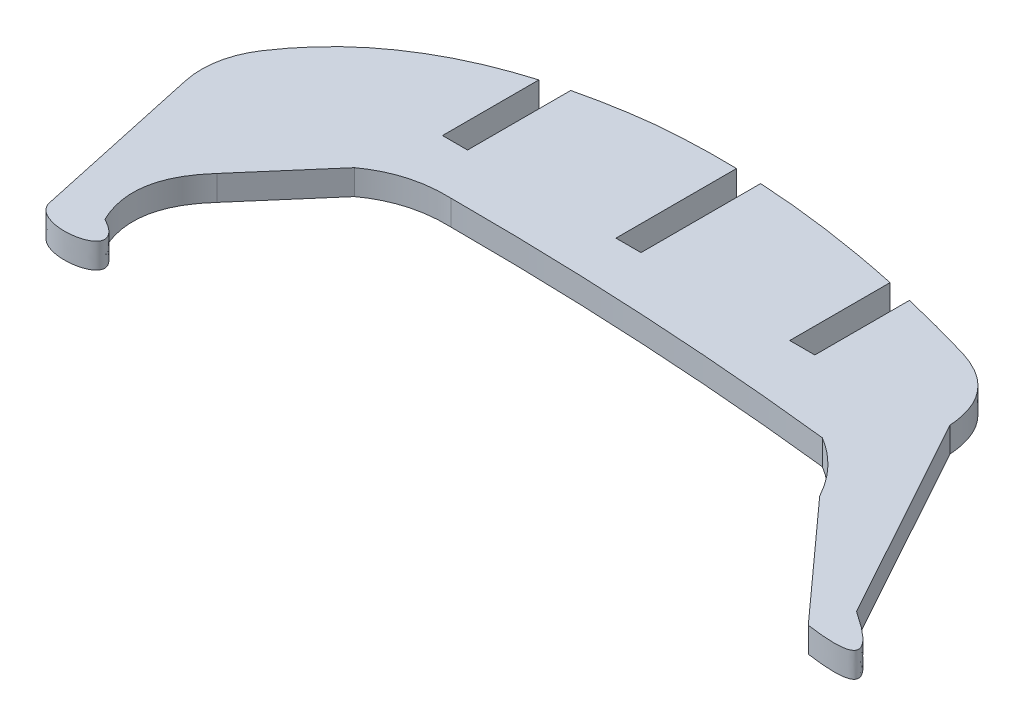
ISO-10303-21;
HEADER;
FILE_DESCRIPTION(('STEP AP214'),'2;1');
FILE_NAME('part.step','',(''),(''),'','','');
FILE_SCHEMA(('AUTOMOTIVE_DESIGN { 1 0 10303 214 1 1 1 1 }'));
ENDSEC;
DATA;
#1=APPLICATION_CONTEXT('core data for automotive mechanical design processes');
#2=APPLICATION_PROTOCOL_DEFINITION('international standard','automotive_design',2000,#1);
#3=PRODUCT_CONTEXT('',#1,'mechanical');
#4=PRODUCT('Part','Part','',(#3));
#5=PRODUCT_RELATED_PRODUCT_CATEGORY('part','',(#4));
#6=PRODUCT_DEFINITION_FORMATION('','',#4);
#7=PRODUCT_DEFINITION_CONTEXT('part definition',#1,'design');
#8=PRODUCT_DEFINITION('design','',#6,#7);
#9=PRODUCT_DEFINITION_SHAPE('','',#8);
#10=(LENGTH_UNIT() NAMED_UNIT(*) SI_UNIT(.MILLI.,.METRE.));
#11=(NAMED_UNIT(*) PLANE_ANGLE_UNIT() SI_UNIT($,.RADIAN.));
#12=(NAMED_UNIT(*) SI_UNIT($,.STERADIAN.) SOLID_ANGLE_UNIT());
#13=UNCERTAINTY_MEASURE_WITH_UNIT(LENGTH_MEASURE(1.E-05),#10,'distance_accuracy_value','');
#14=(GEOMETRIC_REPRESENTATION_CONTEXT(3) GLOBAL_UNCERTAINTY_ASSIGNED_CONTEXT((#13)) GLOBAL_UNIT_ASSIGNED_CONTEXT((#10,
#11,#12)) REPRESENTATION_CONTEXT('',''));
#15=CARTESIAN_POINT('',(0.,0.,0.));
#16=DIRECTION('',(0.,0.,1.));
#17=DIRECTION('',(1.,0.,0.));
#18=AXIS2_PLACEMENT_3D('',#15,#16,#17);
#19=CARTESIAN_POINT('',(18.7065995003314,3.,-27.285407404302));
#20=DIRECTION('',(1.,0.,0.));
#21=DIRECTION('',(0.,0.,-1.));
#22=AXIS2_PLACEMENT_3D('',#19,#20,#21);
#23=PLANE('',#22);
#24=DIRECTION('',(0.,0.,1.));
#25=VECTOR('',#24,1.);
#26=CARTESIAN_POINT('',(18.7065995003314,0.,-27.285407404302));
#27=LINE('',#26,#25);
#28=CARTESIAN_POINT('',(18.7065995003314,0.,-27.285407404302));
#29=VERTEX_POINT('',#28);
#30=CARTESIAN_POINT('',(18.7065995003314,0.,-12.978867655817));
#31=VERTEX_POINT('',#30);
#32=EDGE_CURVE('E245',#29,#31,#27,.T.);
#33=ORIENTED_EDGE('',*,*,#32,.T.);
#34=DIRECTION('',(0.,-1.,0.));
#35=VECTOR('',#34,1.);
#36=CARTESIAN_POINT('',(18.7065995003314,3.,-12.978867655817));
#37=LINE('',#36,#35);
#38=CARTESIAN_POINT('',(18.7065995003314,3.,-12.978867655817));
#39=VERTEX_POINT('',#38);
#40=EDGE_CURVE('E11',#39,#31,#37,.T.);
#41=ORIENTED_EDGE('',*,*,#40,.F.);
#42=DIRECTION('',(0.,0.,1.));
#43=VECTOR('',#42,1.);
#44=CARTESIAN_POINT('',(18.7065995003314,3.,-27.285407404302));
#45=LINE('',#44,#43);
#46=CARTESIAN_POINT('',(18.7065995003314,3.,-27.285407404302));
#47=VERTEX_POINT('',#46);
#48=EDGE_CURVE('E146',#47,#39,#45,.T.);
#49=ORIENTED_EDGE('',*,*,#48,.F.);
#50=DIRECTION('',(0.,-1.,0.));
#51=VECTOR('',#50,1.);
#52=CARTESIAN_POINT('',(18.7065995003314,3.,-27.285407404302));
#53=LINE('',#52,#51);
#54=EDGE_CURVE('E55',#47,#29,#53,.T.);
#55=ORIENTED_EDGE('',*,*,#54,.T.);
#56=EDGE_LOOP('',(#33,#41,#49,#55));
#57=FACE_BOUND('',#56,.T.);
#58=ADVANCED_FACE('F39',(#57),#23,.F.);
#59=CARTESIAN_POINT('',(15.7065994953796,3.,-12.978867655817));
#60=DIRECTION('',(0.,0.,-1.));
#61=DIRECTION('',(-1.,0.,0.));
#62=AXIS2_PLACEMENT_3D('',#59,#60,#61);
#63=PLANE('',#62);
#64=DIRECTION('',(1.,0.,0.));
#65=VECTOR('',#64,1.);
#66=CARTESIAN_POINT('',(15.7065994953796,0.,-12.978867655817));
#67=LINE('',#66,#65);
#68=CARTESIAN_POINT('',(15.7065994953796,0.,-12.978867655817));
#69=VERTEX_POINT('',#68);
#70=EDGE_CURVE('E486',#69,#31,#67,.T.);
#71=ORIENTED_EDGE('',*,*,#70,.F.);
#72=DIRECTION('',(0.,-1.,0.));
#73=VECTOR('',#72,1.);
#74=CARTESIAN_POINT('',(15.7065994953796,3.,-12.978867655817));
#75=LINE('',#74,#73);
#76=CARTESIAN_POINT('',(15.7065994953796,3.,-12.978867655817));
#77=VERTEX_POINT('',#76);
#78=EDGE_CURVE('E47',#77,#69,#75,.T.);
#79=ORIENTED_EDGE('',*,*,#78,.F.);
#80=DIRECTION('',(1.,0.,0.));
#81=VECTOR('',#80,1.);
#82=CARTESIAN_POINT('',(15.7065994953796,3.,-12.978867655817));
#83=LINE('',#82,#81);
#84=EDGE_CURVE('E658',#77,#39,#83,.T.);
#85=ORIENTED_EDGE('',*,*,#84,.T.);
#86=ORIENTED_EDGE('',*,*,#40,.T.);
#87=EDGE_LOOP('',(#71,#79,#85,#86));
#88=FACE_BOUND('',#87,.T.);
#89=ADVANCED_FACE('F487',(#88),#63,.T.);
#90=CARTESIAN_POINT('',(15.7065994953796,3.,-27.4047164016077));
#91=DIRECTION('',(1.,0.,0.));
#92=DIRECTION('',(0.,0.,-1.));
#93=AXIS2_PLACEMENT_3D('',#90,#91,#92);
#94=PLANE('',#93);
#95=DIRECTION('',(0.,0.,1.));
#96=VECTOR('',#95,1.);
#97=CARTESIAN_POINT('',(15.7065994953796,0.,-27.4047164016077));
#98=LINE('',#97,#96);
#99=CARTESIAN_POINT('',(15.7065994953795,0.,-27.4047164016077));
#100=VERTEX_POINT('',#99);
#101=EDGE_CURVE('E479',#100,#69,#98,.T.);
#102=ORIENTED_EDGE('',*,*,#101,.F.);
#103=DIRECTION('',(0.,-1.,0.));
#104=VECTOR('',#103,1.);
#105=CARTESIAN_POINT('',(15.7065994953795,3.,-27.4047164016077));
#106=LINE('',#105,#104);
#107=CARTESIAN_POINT('',(15.7065994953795,3.,-27.4047164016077));
#108=VERTEX_POINT('',#107);
#109=EDGE_CURVE('E472',#108,#100,#106,.T.);
#110=ORIENTED_EDGE('',*,*,#109,.F.);
#111=DIRECTION('',(0.,0.,1.));
#112=VECTOR('',#111,1.);
#113=CARTESIAN_POINT('',(15.7065994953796,3.,-27.4047164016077));
#114=LINE('',#113,#112);
#115=EDGE_CURVE('E482',#108,#77,#114,.T.);
#116=ORIENTED_EDGE('',*,*,#115,.T.);
#117=ORIENTED_EDGE('',*,*,#78,.T.);
#118=EDGE_LOOP('',(#102,#110,#116,#117));
#119=FACE_BOUND('',#118,.T.);
#120=ADVANCED_FACE('F477',(#119),#94,.T.);
#121=CARTESIAN_POINT('',(6.23728601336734,3.,-27.0796653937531));
#122=CARTESIAN_POINT('',(9.2708349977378,3.,-27.3725993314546));
#123=CARTESIAN_POINT('',(12.4272728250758,3.,-27.4809496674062));
#124=CARTESIAN_POINT('',(15.7065994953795,3.,-27.4047164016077));
#125=B_SPLINE_CURVE_WITH_KNOTS('',3,(#121,#122,#123,#124),.UNSPECIFIED.,.F.,.F.,(4,4),
(0.396665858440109,0.548130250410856),.UNSPECIFIED.);
#126=DIRECTION('',(0.,-1.,0.));
#127=VECTOR('',#126,1.);
#128=SURFACE_OF_LINEAR_EXTRUSION('',#125,#127);
#129=CARTESIAN_POINT('',(6.23728601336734,0.,-27.0796653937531));
#130=CARTESIAN_POINT('',(9.2708349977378,0.,-27.3725993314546));
#131=CARTESIAN_POINT('',(12.4272728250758,0.,-27.4809496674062));
#132=CARTESIAN_POINT('',(15.7065994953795,0.,-27.4047164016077));
#133=B_SPLINE_CURVE_WITH_KNOTS('',3,(#129,#130,#131,#132),.UNSPECIFIED.,.F.,.F.,(4,4),
(0.396665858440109,0.548130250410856),.UNSPECIFIED.);
#134=CARTESIAN_POINT('',(6.23728601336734,0.,-27.0796653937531));
#135=VERTEX_POINT('',#134);
#136=EDGE_CURVE('E491',#135,#100,#133,.T.);
#137=ORIENTED_EDGE('',*,*,#136,.F.);
#138=DIRECTION('',(0.,-1.,0.));
#139=VECTOR('',#138,1.);
#140=CARTESIAN_POINT('',(6.23728601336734,3.,-27.0796653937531));
#141=LINE('',#140,#139);
#142=CARTESIAN_POINT('',(6.23728601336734,3.,-27.0796653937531));
#143=VERTEX_POINT('',#142);
#144=EDGE_CURVE('E470',#143,#135,#141,.T.);
#145=ORIENTED_EDGE('',*,*,#144,.F.);
#146=EDGE_CURVE('E432',#143,#108,#125,.T.);
#147=ORIENTED_EDGE('',*,*,#146,.T.);
#148=ORIENTED_EDGE('',*,*,#109,.T.);
#149=EDGE_LOOP('',(#137,#145,#147,#148));
#150=FACE_BOUND('',#149,.T.);
#151=ADVANCED_FACE('F421',(#150),#128,.T.);
#152=CARTESIAN_POINT('',(-2.29340050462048,3.,-25.5718308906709));
#153=CARTESIAN_POINT('',(1.93618210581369,3.,-26.5898860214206));
#154=CARTESIAN_POINT('',(6.23728601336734,3.,-27.0796653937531));
#155=B_SPLINE_CURVE_WITH_KNOTS('',2,(#152,#153,#154),.UNSPECIFIED.,.F.,.F.,(3,3),
(0.783562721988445,1.),.UNSPECIFIED.);
#156=DIRECTION('',(0.,-1.,0.));
#157=VECTOR('',#156,1.);
#158=SURFACE_OF_LINEAR_EXTRUSION('',#155,#157);
#159=CARTESIAN_POINT('',(-2.29340050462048,0.,-25.5718308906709));
#160=CARTESIAN_POINT('',(1.93618210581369,0.,-26.5898860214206));
#161=CARTESIAN_POINT('',(6.23728601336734,0.,-27.0796653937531));
#162=B_SPLINE_CURVE_WITH_KNOTS('',2,(#159,#160,#161),.UNSPECIFIED.,.F.,.F.,(3,3),
(0.783562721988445,1.),.UNSPECIFIED.);
#163=CARTESIAN_POINT('',(-2.29340050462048,0.,-25.5718308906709));
#164=VERTEX_POINT('',#163);
#165=EDGE_CURVE('E493',#164,#135,#162,.T.);
#166=ORIENTED_EDGE('',*,*,#165,.F.);
#167=DIRECTION('',(0.,-1.,0.));
#168=VECTOR('',#167,1.);
#169=CARTESIAN_POINT('',(-2.29340050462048,3.,-25.5718308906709));
#170=LINE('',#169,#168);
#171=CARTESIAN_POINT('',(-2.29340050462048,3.,-25.5718308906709));
#172=VERTEX_POINT('',#171);
#173=EDGE_CURVE('E468',#172,#164,#170,.T.);
#174=ORIENTED_EDGE('',*,*,#173,.F.);
#175=EDGE_CURVE('E425',#172,#143,#155,.T.);
#176=ORIENTED_EDGE('',*,*,#175,.T.);
#177=ORIENTED_EDGE('',*,*,#144,.T.);
#178=EDGE_LOOP('',(#166,#174,#176,#177));
#179=FACE_BOUND('',#178,.T.);
#180=ADVANCED_FACE('F416',(#179),#158,.T.);
#181=CARTESIAN_POINT('',(-2.29340050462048,3.,-25.5718308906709));
#182=DIRECTION('',(1.,0.,0.));
#183=DIRECTION('',(0.,0.,-1.));
#184=AXIS2_PLACEMENT_3D('',#181,#182,#183);
#185=PLANE('',#184);
#186=DIRECTION('',(0.,0.,1.));
#187=VECTOR('',#186,1.);
#188=CARTESIAN_POINT('',(-2.29340050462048,0.,-25.5718308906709));
#189=LINE('',#188,#187);
#190=CARTESIAN_POINT('',(-2.29340050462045,0.,-13.2320208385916));
#191=VERTEX_POINT('',#190);
#192=EDGE_CURVE('E504',#164,#191,#189,.T.);
#193=ORIENTED_EDGE('',*,*,#192,.T.);
#194=DIRECTION('',(0.,-1.,0.));
#195=VECTOR('',#194,1.);
#196=CARTESIAN_POINT('',(-2.29340050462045,3.,-13.2320208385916));
#197=LINE('',#196,#195);
#198=CARTESIAN_POINT('',(-2.29340050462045,3.,-13.2320208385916));
#199=VERTEX_POINT('',#198);
#200=EDGE_CURVE('E466',#199,#191,#197,.T.);
#201=ORIENTED_EDGE('',*,*,#200,.F.);
#202=DIRECTION('',(0.,0.,1.));
#203=VECTOR('',#202,1.);
#204=CARTESIAN_POINT('',(-2.29340050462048,3.,-25.5718308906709));
#205=LINE('',#204,#203);
#206=EDGE_CURVE('E431',#172,#199,#205,.T.);
#207=ORIENTED_EDGE('',*,*,#206,.F.);
#208=ORIENTED_EDGE('',*,*,#173,.T.);
#209=EDGE_LOOP('',(#193,#201,#207,#208));
#210=FACE_BOUND('',#209,.T.);
#211=ADVANCED_FACE('F412',(#210),#185,.F.);
#212=CARTESIAN_POINT('',(-5.29340051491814,3.,-13.2320208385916));
#213=DIRECTION('',(0.,0.,-1.));
#214=DIRECTION('',(-1.,0.,0.));
#215=AXIS2_PLACEMENT_3D('',#212,#213,#214);
#216=PLANE('',#215);
#217=DIRECTION('',(1.,0.,0.));
#218=VECTOR('',#217,1.);
#219=CARTESIAN_POINT('',(-5.29340051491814,0.,-13.2320208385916));
#220=LINE('',#219,#218);
#221=CARTESIAN_POINT('',(-5.29340051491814,0.,-13.2320208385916));
#222=VERTEX_POINT('',#221);
#223=EDGE_CURVE('E510',#222,#191,#220,.T.);
#224=ORIENTED_EDGE('',*,*,#223,.F.);
#225=DIRECTION('',(0.,-1.,0.));
#226=VECTOR('',#225,1.);
#227=CARTESIAN_POINT('',(-5.29340051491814,3.,-13.2320208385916));
#228=LINE('',#227,#226);
#229=CARTESIAN_POINT('',(-5.29340051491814,3.,-13.2320208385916));
#230=VERTEX_POINT('',#229);
#231=EDGE_CURVE('E446',#230,#222,#228,.T.);
#232=ORIENTED_EDGE('',*,*,#231,.F.);
#233=DIRECTION('',(1.,0.,0.));
#234=VECTOR('',#233,1.);
#235=CARTESIAN_POINT('',(-5.29340051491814,3.,-13.2320208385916));
#236=LINE('',#235,#234);
#237=EDGE_CURVE('E440',#230,#199,#236,.T.);
#238=ORIENTED_EDGE('',*,*,#237,.T.);
#239=ORIENTED_EDGE('',*,*,#200,.T.);
#240=EDGE_LOOP('',(#224,#232,#238,#239));
#241=FACE_BOUND('',#240,.T.);
#242=ADVANCED_FACE('F408',(#241),#216,.T.);
#243=CARTESIAN_POINT('',(-5.29340051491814,3.,-24.765059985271));
#244=DIRECTION('',(1.,0.,0.));
#245=DIRECTION('',(0.,0.,-1.));
#246=AXIS2_PLACEMENT_3D('',#243,#244,#245);
#247=PLANE('',#246);
#248=DIRECTION('',(0.,0.,1.));
#249=VECTOR('',#248,1.);
#250=CARTESIAN_POINT('',(-5.29340051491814,0.,-24.765059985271));
#251=LINE('',#250,#249);
#252=CARTESIAN_POINT('',(-5.29340051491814,0.,-24.765059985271));
#253=VERTEX_POINT('',#252);
#254=EDGE_CURVE('E513',#253,#222,#251,.T.);
#255=ORIENTED_EDGE('',*,*,#254,.F.);
#256=DIRECTION('',(0.,-1.,0.));
#257=VECTOR('',#256,1.);
#258=CARTESIAN_POINT('',(-5.29340051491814,3.,-24.765059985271));
#259=LINE('',#258,#257);
#260=CARTESIAN_POINT('',(-5.29340051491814,3.,-24.765059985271));
#261=VERTEX_POINT('',#260);
#262=EDGE_CURVE('E448',#261,#253,#259,.T.);
#263=ORIENTED_EDGE('',*,*,#262,.F.);
#264=DIRECTION('',(0.,0.,1.));
#265=VECTOR('',#264,1.);
#266=CARTESIAN_POINT('',(-5.29340051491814,3.,-24.765059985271));
#267=LINE('',#266,#265);
#268=EDGE_CURVE('E393',#261,#230,#267,.T.);
#269=ORIENTED_EDGE('',*,*,#268,.T.);
#270=ORIENTED_EDGE('',*,*,#231,.T.);
#271=EDGE_LOOP('',(#255,#263,#269,#270));
#272=FACE_BOUND('',#271,.T.);
#273=ADVANCED_FACE('F404',(#272),#247,.T.);
#274=CARTESIAN_POINT('',(-24.9177923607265,3.,-11.1706000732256));
#275=CARTESIAN_POINT('',(-21.2160454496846,3.,-16.7884184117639));
#276=CARTESIAN_POINT('',(-14.6220548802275,3.,-21.5472950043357));
#277=CARTESIAN_POINT('',(-7.02427865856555,3.,-24.2475556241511));
#278=CARTESIAN_POINT('',(-5.29340051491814,3.,-24.765059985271));
#279=B_SPLINE_CURVE_WITH_KNOTS('',3,(#274,#275,#276,#277,#278),.UNSPECIFIED.,.F.,.F.,(4,1,4),
(0.102537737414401,0.571137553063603,0.706215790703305),.UNSPECIFIED.);
#280=DIRECTION('',(0.,-1.,0.));
#281=VECTOR('',#280,1.);
#282=SURFACE_OF_LINEAR_EXTRUSION('',#279,#281);
#283=CARTESIAN_POINT('',(-24.9177923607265,0.,-11.1706000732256));
#284=CARTESIAN_POINT('',(-21.2160454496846,0.,-16.7884184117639));
#285=CARTESIAN_POINT('',(-14.6220548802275,0.,-21.5472950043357));
#286=CARTESIAN_POINT('',(-7.02427865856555,0.,-24.2475556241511));
#287=CARTESIAN_POINT('',(-5.29340051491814,0.,-24.765059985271));
#288=B_SPLINE_CURVE_WITH_KNOTS('',3,(#283,#284,#285,#286,#287),.UNSPECIFIED.,.F.,.F.,(4,1,4),
(0.102537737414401,0.571137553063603,0.706215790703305),.UNSPECIFIED.);
#289=CARTESIAN_POINT('',(-24.9177923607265,0.,-11.1706000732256));
#290=VERTEX_POINT('',#289);
#291=EDGE_CURVE('E454',#290,#253,#288,.T.);
#292=ORIENTED_EDGE('',*,*,#291,.F.);
#293=DIRECTION('',(0.,-1.,0.));
#294=VECTOR('',#293,1.);
#295=CARTESIAN_POINT('',(-24.9177923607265,3.,-11.1706000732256));
#296=LINE('',#295,#294);
#297=CARTESIAN_POINT('',(-24.9177923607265,3.,-11.1706000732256));
#298=VERTEX_POINT('',#297);
#299=EDGE_CURVE('E452',#298,#290,#296,.T.);
#300=ORIENTED_EDGE('',*,*,#299,.F.);
#301=EDGE_CURVE('E387',#298,#261,#279,.T.);
#302=ORIENTED_EDGE('',*,*,#301,.T.);
#303=ORIENTED_EDGE('',*,*,#262,.T.);
#304=EDGE_LOOP('',(#292,#300,#302,#303));
#305=FACE_BOUND('',#304,.T.);
#306=ADVANCED_FACE('F399',(#305),#282,.T.);
#307=CARTESIAN_POINT('',(-16.56759153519,3.,-5.66840540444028));
#308=DIRECTION('',(0.,-1.,0.));
#309=DIRECTION('',(0.,0.,-1.));
#310=AXIS2_PLACEMENT_3D('',#307,#308,#309);
#311=CYLINDRICAL_SURFACE('',#310,10.);
#312=CARTESIAN_POINT('',(-16.56759153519,0.,-5.66840540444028));
#313=DIRECTION('',(0.,-1.,0.));
#314=DIRECTION('',(0.,0.,-1.));
#315=AXIS2_PLACEMENT_3D('',#312,#313,#314);
#316=CIRCLE('',#315,10.);
#317=CARTESIAN_POINT('',(-26.340587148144,0.,-3.54978397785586));
#318=VERTEX_POINT('',#317);
#319=EDGE_CURVE('E519',#318,#290,#316,.T.);
#320=ORIENTED_EDGE('',*,*,#319,.F.);
#321=DIRECTION('',(0.,-1.,0.));
#322=VECTOR('',#321,1.);
#323=CARTESIAN_POINT('',(-26.340587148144,3.,-3.54978397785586));
#324=LINE('',#323,#322);
#325=CARTESIAN_POINT('',(-26.340587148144,3.,-3.54978397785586));
#326=VERTEX_POINT('',#325);
#327=EDGE_CURVE('E458',#326,#318,#324,.T.);
#328=ORIENTED_EDGE('',*,*,#327,.F.);
#329=CARTESIAN_POINT('',(-16.56759153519,3.,-5.66840540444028));
#330=DIRECTION('',(0.,-1.,0.));
#331=DIRECTION('',(0.,0.,-1.));
#332=AXIS2_PLACEMENT_3D('',#329,#330,#331);
#333=CIRCLE('',#332,10.);
#334=EDGE_CURVE('E384',#326,#298,#333,.T.);
#335=ORIENTED_EDGE('',*,*,#334,.T.);
#336=ORIENTED_EDGE('',*,*,#299,.T.);
#337=EDGE_LOOP('',(#320,#328,#335,#336));
#338=FACE_BOUND('',#337,.T.);
#339=ADVANCED_FACE('F403',(#338),#311,.T.);
#340=CARTESIAN_POINT('',(-21.8908454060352,3.,16.9764440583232));
#341=DIRECTION('',(-0.977299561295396,0.,0.211862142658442));
#342=DIRECTION('',(0.211862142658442,0.,0.977299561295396));
#343=AXIS2_PLACEMENT_3D('',#340,#341,#342);
#344=PLANE('',#343);
#345=DIRECTION('',(-0.211862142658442,0.,-0.977299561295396));
#346=VECTOR('',#345,1.);
#347=CARTESIAN_POINT('',(-21.8908454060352,0.,16.9764440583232));
#348=LINE('',#347,#346);
#349=CARTESIAN_POINT('',(-21.8908454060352,0.,16.9764440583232));
#350=VERTEX_POINT('',#349);
#351=EDGE_CURVE('E524',#350,#318,#348,.T.);
#352=ORIENTED_EDGE('',*,*,#351,.F.);
#353=DIRECTION('',(0.,-1.,0.));
#354=VECTOR('',#353,1.);
#355=CARTESIAN_POINT('',(-21.8908454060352,3.,16.9764440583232));
#356=LINE('',#355,#354);
#357=CARTESIAN_POINT('',(-21.8908454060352,3.,16.9764440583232));
#358=VERTEX_POINT('',#357);
#359=EDGE_CURVE('E461',#358,#350,#356,.T.);
#360=ORIENTED_EDGE('',*,*,#359,.F.);
#361=DIRECTION('',(-0.211862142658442,0.,-0.977299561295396));
#362=VECTOR('',#361,1.);
#363=CARTESIAN_POINT('',(-21.8908454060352,3.,16.9764440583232));
#364=LINE('',#363,#362);
#365=EDGE_CURVE('E378',#358,#326,#364,.T.);
#366=ORIENTED_EDGE('',*,*,#365,.T.);
#367=ORIENTED_EDGE('',*,*,#327,.T.);
#368=EDGE_LOOP('',(#352,#360,#366,#367));
#369=FACE_BOUND('',#368,.T.);
#370=ADVANCED_FACE('F644',(#369),#344,.T.);
#371=CARTESIAN_POINT('',(-16.8074481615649,3.,15.6175941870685));
#372=CARTESIAN_POINT('',(-10.2437263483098,3.,19.1643978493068));
#373=CARTESIAN_POINT('',(-21.3626547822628,3.,21.0524493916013));
#374=CARTESIAN_POINT('',(-21.8908454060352,3.,16.9764440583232));
#375=B_SPLINE_CURVE_WITH_KNOTS('',3,(#371,#372,#373,#374),.UNSPECIFIED.,.F.,.F.,(4,4),(0.,1.),.UNSPECIFIED.);
#376=DIRECTION('',(0.,-1.,0.));
#377=VECTOR('',#376,1.);
#378=SURFACE_OF_LINEAR_EXTRUSION('',#375,#377);
#379=CARTESIAN_POINT('',(-16.8074481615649,0.,15.6175941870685));
#380=CARTESIAN_POINT('',(-10.2437263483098,0.,19.1643978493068));
#381=CARTESIAN_POINT('',(-21.3626547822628,0.,21.0524493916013));
#382=CARTESIAN_POINT('',(-21.8908454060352,0.,16.9764440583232));
#383=B_SPLINE_CURVE_WITH_KNOTS('',3,(#379,#380,#381,#382),.UNSPECIFIED.,.F.,.F.,(4,4),(0.,1.),.UNSPECIFIED.);
#384=CARTESIAN_POINT('',(-16.8074481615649,0.,15.6175941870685));
#385=VERTEX_POINT('',#384);
#386=EDGE_CURVE('E527',#385,#350,#383,.T.);
#387=ORIENTED_EDGE('',*,*,#386,.F.);
#388=DIRECTION('',(0.,-1.,0.));
#389=VECTOR('',#388,1.);
#390=CARTESIAN_POINT('',(-16.8074481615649,3.,15.6175941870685));
#391=LINE('',#390,#389);
#392=CARTESIAN_POINT('',(-16.8074481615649,3.,15.6175941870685));
#393=VERTEX_POINT('',#392);
#394=EDGE_CURVE('E637',#393,#385,#391,.T.);
#395=ORIENTED_EDGE('',*,*,#394,.F.);
#396=EDGE_CURVE('E369',#393,#358,#375,.T.);
#397=ORIENTED_EDGE('',*,*,#396,.T.);
#398=ORIENTED_EDGE('',*,*,#359,.T.);
#399=EDGE_LOOP('',(#387,#395,#397,#398));
#400=FACE_BOUND('',#399,.T.);
#401=ADVANCED_FACE('F360',(#400),#378,.T.);
#402=CARTESIAN_POINT('',(-14.8588125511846,3.,4.18322765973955));
#403=CARTESIAN_POINT('',(-19.7412124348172,3.,9.59925535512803));
#404=CARTESIAN_POINT('',(-16.8074481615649,3.,15.6175941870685));
#405=B_SPLINE_CURVE_WITH_KNOTS('',2,(#402,#403,#404),.UNSPECIFIED.,.F.,.F.,(3,3),(0.,1.),.UNSPECIFIED.);
#406=DIRECTION('',(0.,-1.,0.));
#407=VECTOR('',#406,1.);
#408=SURFACE_OF_LINEAR_EXTRUSION('',#405,#407);
#409=CARTESIAN_POINT('',(-14.8588125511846,0.,4.18322765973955));
#410=CARTESIAN_POINT('',(-19.7412124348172,0.,9.59925535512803));
#411=CARTESIAN_POINT('',(-16.8074481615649,0.,15.6175941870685));
#412=B_SPLINE_CURVE_WITH_KNOTS('',2,(#409,#410,#411),.UNSPECIFIED.,.F.,.F.,(3,3),(0.,1.),.UNSPECIFIED.);
#413=CARTESIAN_POINT('',(-14.8588125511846,0.,4.18322765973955));
#414=VERTEX_POINT('',#413);
#415=EDGE_CURVE('E532',#414,#385,#412,.T.);
#416=ORIENTED_EDGE('',*,*,#415,.F.);
#417=DIRECTION('',(0.,-1.,0.));
#418=VECTOR('',#417,1.);
#419=CARTESIAN_POINT('',(-14.8588125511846,3.,4.18322765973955));
#420=LINE('',#419,#418);
#421=CARTESIAN_POINT('',(-14.8588125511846,3.,4.18322765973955));
#422=VERTEX_POINT('',#421);
#423=EDGE_CURVE('E635',#422,#414,#420,.T.);
#424=ORIENTED_EDGE('',*,*,#423,.F.);
#425=EDGE_CURVE('E364',#422,#393,#405,.T.);
#426=ORIENTED_EDGE('',*,*,#425,.T.);
#427=ORIENTED_EDGE('',*,*,#394,.T.);
#428=EDGE_LOOP('',(#416,#424,#426,#427));
#429=FACE_BOUND('',#428,.T.);
#430=ADVANCED_FACE('F356',(#429),#408,.T.);
#431=CARTESIAN_POINT('',(-7.23371668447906,3.,-4.64367499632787));
#432=DIRECTION('',(0.756744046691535,0.,0.653711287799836));
#433=DIRECTION('',(0.653711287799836,0.,-0.756744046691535));
#434=AXIS2_PLACEMENT_3D('',#431,#432,#433);
#435=PLANE('',#434);
#436=DIRECTION('',(-0.653711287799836,0.,0.756744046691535));
#437=VECTOR('',#436,1.);
#438=CARTESIAN_POINT('',(-7.23371668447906,0.,-4.64367499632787));
#439=LINE('',#438,#437);
#440=CARTESIAN_POINT('',(-7.23371668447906,0.,-4.64367499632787));
#441=VERTEX_POINT('',#440);
#442=EDGE_CURVE('E540',#441,#414,#439,.T.);
#443=ORIENTED_EDGE('',*,*,#442,.F.);
#444=DIRECTION('',(0.,-1.,0.));
#445=VECTOR('',#444,1.);
#446=CARTESIAN_POINT('',(-7.23371668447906,3.,-4.64367499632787));
#447=LINE('',#446,#445);
#448=CARTESIAN_POINT('',(-7.23371668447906,3.,-4.64367499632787));
#449=VERTEX_POINT('',#448);
#450=EDGE_CURVE('E633',#449,#441,#447,.T.);
#451=ORIENTED_EDGE('',*,*,#450,.F.);
#452=DIRECTION('',(-0.653711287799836,0.,0.756744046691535));
#453=VECTOR('',#452,1.);
#454=CARTESIAN_POINT('',(-7.23371668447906,3.,-4.64367499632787));
#455=LINE('',#454,#453);
#456=EDGE_CURVE('E344',#449,#422,#455,.T.);
#457=ORIENTED_EDGE('',*,*,#456,.T.);
#458=ORIENTED_EDGE('',*,*,#423,.T.);
#459=EDGE_LOOP('',(#443,#451,#457,#458));
#460=FACE_BOUND('',#459,.T.);
#461=ADVANCED_FACE('F352',(#460),#435,.T.);
#462=CARTESIAN_POINT('',(1.69446574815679,3.,-7.25441614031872));
#463=CARTESIAN_POINT('',(-3.38712802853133,3.,-7.43197826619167));
#464=CARTESIAN_POINT('',(-7.23371668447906,3.,-4.64367499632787));
#465=B_SPLINE_CURVE_WITH_KNOTS('',2,(#462,#463,#464),.UNSPECIFIED.,.F.,.F.,(3,3),(0.,1.),.UNSPECIFIED.);
#466=DIRECTION('',(0.,-1.,0.));
#467=VECTOR('',#466,1.);
#468=SURFACE_OF_LINEAR_EXTRUSION('',#465,#467);
#469=CARTESIAN_POINT('',(1.69446574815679,0.,-7.25441614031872));
#470=CARTESIAN_POINT('',(-3.38712802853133,0.,-7.43197826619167));
#471=CARTESIAN_POINT('',(-7.23371668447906,0.,-4.64367499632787));
#472=B_SPLINE_CURVE_WITH_KNOTS('',2,(#469,#470,#471),.UNSPECIFIED.,.F.,.F.,(3,3),(0.,1.),.UNSPECIFIED.);
#473=CARTESIAN_POINT('',(1.69446574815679,0.,-7.25441614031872));
#474=VERTEX_POINT('',#473);
#475=EDGE_CURVE('E546',#474,#441,#472,.T.);
#476=ORIENTED_EDGE('',*,*,#475,.F.);
#477=DIRECTION('',(0.,-1.,0.));
#478=VECTOR('',#477,1.);
#479=CARTESIAN_POINT('',(1.69446574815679,3.,-7.25441614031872));
#480=LINE('',#479,#478);
#481=CARTESIAN_POINT('',(1.69446574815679,3.,-7.25441614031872));
#482=VERTEX_POINT('',#481);
#483=EDGE_CURVE('E631',#482,#474,#480,.T.);
#484=ORIENTED_EDGE('',*,*,#483,.F.);
#485=EDGE_CURVE('E335',#482,#449,#465,.T.);
#486=ORIENTED_EDGE('',*,*,#485,.T.);
#487=ORIENTED_EDGE('',*,*,#450,.T.);
#488=EDGE_LOOP('',(#476,#484,#486,#487));
#489=FACE_BOUND('',#488,.T.);
#490=ADVANCED_FACE('F349',(#489),#468,.T.);
#491=CARTESIAN_POINT('',(48.7312218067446,3.,-4.64367499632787));
#492=CARTESIAN_POINT('',(25.25019166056,3.,-7.2749697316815));
#493=CARTESIAN_POINT('',(1.69446574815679,3.,-7.25441614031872));
#494=B_SPLINE_CURVE_WITH_KNOTS('',2,(#491,#492,#493),.UNSPECIFIED.,.F.,.F.,(3,3),(0.,1.),.UNSPECIFIED.);
#495=DIRECTION('',(0.,-1.,0.));
#496=VECTOR('',#495,1.);
#497=SURFACE_OF_LINEAR_EXTRUSION('',#494,#496);
#498=CARTESIAN_POINT('',(48.7312218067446,0.,-4.64367499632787));
#499=CARTESIAN_POINT('',(25.25019166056,0.,-7.2749697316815));
#500=CARTESIAN_POINT('',(1.69446574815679,0.,-7.25441614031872));
#501=B_SPLINE_CURVE_WITH_KNOTS('',2,(#498,#499,#500),.UNSPECIFIED.,.F.,.F.,(3,3),(0.,1.),.UNSPECIFIED.);
#502=CARTESIAN_POINT('',(48.7312218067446,0.,-4.64367499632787));
#503=VERTEX_POINT('',#502);
#504=EDGE_CURVE('E551',#503,#474,#501,.T.);
#505=ORIENTED_EDGE('',*,*,#504,.F.);
#506=DIRECTION('',(0.,-1.,0.));
#507=VECTOR('',#506,1.);
#508=CARTESIAN_POINT('',(48.7312218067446,3.,-4.64367499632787));
#509=LINE('',#508,#507);
#510=CARTESIAN_POINT('',(48.7312218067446,3.,-4.64367499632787));
#511=VERTEX_POINT('',#510);
#512=EDGE_CURVE('E629',#511,#503,#509,.T.);
#513=ORIENTED_EDGE('',*,*,#512,.F.);
#514=EDGE_CURVE('E326',#511,#482,#494,.T.);
#515=ORIENTED_EDGE('',*,*,#514,.T.);
#516=ORIENTED_EDGE('',*,*,#483,.T.);
#517=EDGE_LOOP('',(#505,#513,#515,#516));
#518=FACE_BOUND('',#517,.T.);
#519=ADVANCED_FACE('F317',(#518),#497,.T.);
#520=CARTESIAN_POINT('',(54.6101392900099,3.,1.55018449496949));
#521=CARTESIAN_POINT('',(52.4822318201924,3.,-2.39163415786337));
#522=CARTESIAN_POINT('',(48.7312218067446,3.,-4.64367499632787));
#523=B_SPLINE_CURVE_WITH_KNOTS('',2,(#520,#521,#522),.UNSPECIFIED.,.F.,.F.,(3,3),(0.,1.),.UNSPECIFIED.);
#524=DIRECTION('',(0.,-1.,0.));
#525=VECTOR('',#524,1.);
#526=SURFACE_OF_LINEAR_EXTRUSION('',#523,#525);
#527=CARTESIAN_POINT('',(54.6101392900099,0.,1.55018449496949));
#528=CARTESIAN_POINT('',(52.4822318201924,0.,-2.39163415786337));
#529=CARTESIAN_POINT('',(48.7312218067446,0.,-4.64367499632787));
#530=B_SPLINE_CURVE_WITH_KNOTS('',2,(#527,#528,#529),.UNSPECIFIED.,.F.,.F.,(3,3),(0.,1.),.UNSPECIFIED.);
#531=CARTESIAN_POINT('',(54.6101392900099,0.,1.55018449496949));
#532=VERTEX_POINT('',#531);
#533=EDGE_CURVE('E559',#532,#503,#530,.T.);
#534=ORIENTED_EDGE('',*,*,#533,.F.);
#535=DIRECTION('',(0.,-1.,0.));
#536=VECTOR('',#535,1.);
#537=CARTESIAN_POINT('',(54.6101392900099,3.,1.55018449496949));
#538=LINE('',#537,#536);
#539=CARTESIAN_POINT('',(54.6101392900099,3.,1.55018449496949));
#540=VERTEX_POINT('',#539);
#541=EDGE_CURVE('E627',#540,#532,#538,.T.);
#542=ORIENTED_EDGE('',*,*,#541,.F.);
#543=EDGE_CURVE('E321',#540,#511,#523,.T.);
#544=ORIENTED_EDGE('',*,*,#543,.T.);
#545=ORIENTED_EDGE('',*,*,#512,.T.);
#546=EDGE_LOOP('',(#534,#542,#544,#545));
#547=FACE_BOUND('',#546,.T.);
#548=ADVANCED_FACE('F313',(#547),#526,.T.);
#549=CARTESIAN_POINT('',(67.3128002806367,3.,15.6175941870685));
#550=DIRECTION('',(-0.742191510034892,0.,0.670187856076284));
#551=DIRECTION('',(0.670187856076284,0.,0.742191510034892));
#552=AXIS2_PLACEMENT_3D('',#549,#550,#551);
#553=PLANE('',#552);
#554=DIRECTION('',(-0.670187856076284,0.,-0.742191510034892));
#555=VECTOR('',#554,1.);
#556=CARTESIAN_POINT('',(67.3128002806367,0.,15.6175941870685));
#557=LINE('',#556,#555);
#558=CARTESIAN_POINT('',(67.3128002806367,0.,15.6175941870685));
#559=VERTEX_POINT('',#558);
#560=EDGE_CURVE('E567',#559,#532,#557,.T.);
#561=ORIENTED_EDGE('',*,*,#560,.F.);
#562=DIRECTION('',(0.,-1.,0.));
#563=VECTOR('',#562,1.);
#564=CARTESIAN_POINT('',(67.3128002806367,3.,15.6175941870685));
#565=LINE('',#564,#563);
#566=CARTESIAN_POINT('',(67.3128002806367,3.,15.6175941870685));
#567=VERTEX_POINT('',#566);
#568=EDGE_CURVE('E625',#567,#559,#565,.T.);
#569=ORIENTED_EDGE('',*,*,#568,.F.);
#570=DIRECTION('',(-0.670187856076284,0.,-0.742191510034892));
#571=VECTOR('',#570,1.);
#572=CARTESIAN_POINT('',(67.3128002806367,3.,15.6175941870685));
#573=LINE('',#572,#571);
#574=EDGE_CURVE('E299',#567,#540,#573,.T.);
#575=ORIENTED_EDGE('',*,*,#574,.T.);
#576=ORIENTED_EDGE('',*,*,#541,.T.);
#577=EDGE_LOOP('',(#561,#569,#575,#576));
#578=FACE_BOUND('',#577,.T.);
#579=ADVANCED_FACE('F309',(#578),#553,.T.);
#580=CARTESIAN_POINT('',(68.782529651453,3.,11.3133867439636));
#581=CARTESIAN_POINT('',(77.5212044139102,3.,17.0734372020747));
#582=CARTESIAN_POINT('',(67.3128002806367,3.,15.6175941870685));
#583=B_SPLINE_CURVE_WITH_KNOTS('',2,(#580,#581,#582),.UNSPECIFIED.,.F.,.F.,(3,3),(0.,1.),.UNSPECIFIED.);
#584=DIRECTION('',(0.,-1.,0.));
#585=VECTOR('',#584,1.);
#586=SURFACE_OF_LINEAR_EXTRUSION('',#583,#585);
#587=CARTESIAN_POINT('',(68.782529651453,0.,11.3133867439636));
#588=CARTESIAN_POINT('',(77.5212044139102,0.,17.0734372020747));
#589=CARTESIAN_POINT('',(67.3128002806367,0.,15.6175941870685));
#590=B_SPLINE_CURVE_WITH_KNOTS('',2,(#587,#588,#589),.UNSPECIFIED.,.F.,.F.,(3,3),(0.,1.),.UNSPECIFIED.);
#591=CARTESIAN_POINT('',(68.782529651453,0.,11.3133867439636));
#592=VERTEX_POINT('',#591);
#593=EDGE_CURVE('E573',#592,#559,#590,.T.);
#594=ORIENTED_EDGE('',*,*,#593,.F.);
#595=DIRECTION('',(0.,-1.,0.));
#596=VECTOR('',#595,1.);
#597=CARTESIAN_POINT('',(68.782529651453,3.,11.3133867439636));
#598=LINE('',#597,#596);
#599=CARTESIAN_POINT('',(68.782529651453,3.,11.3133867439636));
#600=VERTEX_POINT('',#599);
#601=EDGE_CURVE('E623',#600,#592,#598,.T.);
#602=ORIENTED_EDGE('',*,*,#601,.F.);
#603=EDGE_CURVE('E293',#600,#567,#583,.T.);
#604=ORIENTED_EDGE('',*,*,#603,.T.);
#605=ORIENTED_EDGE('',*,*,#568,.T.);
#606=EDGE_LOOP('',(#594,#602,#604,#605));
#607=FACE_BOUND('',#606,.T.);
#608=ADVANCED_FACE('F305',(#607),#586,.T.);
#609=CARTESIAN_POINT('',(55.0566484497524,3.,-13.5654188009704));
#610=DIRECTION('',(0.875582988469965,0.,-0.483067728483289));
#611=DIRECTION('',(-0.483067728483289,0.,-0.875582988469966));
#612=AXIS2_PLACEMENT_3D('',#609,#610,#611);
#613=PLANE('',#612);
#614=DIRECTION('',(0.483067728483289,0.,0.875582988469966));
#615=VECTOR('',#614,1.);
#616=CARTESIAN_POINT('',(55.0566484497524,0.,-13.5654188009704));
#617=LINE('',#616,#615);
#618=CARTESIAN_POINT('',(55.0566484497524,0.,-13.5654188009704));
#619=VERTEX_POINT('',#618);
#620=EDGE_CURVE('E578',#619,#592,#617,.T.);
#621=ORIENTED_EDGE('',*,*,#620,.F.);
#622=DIRECTION('',(0.,-1.,0.));
#623=VECTOR('',#622,1.);
#624=CARTESIAN_POINT('',(55.0566484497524,3.,-13.5654188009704));
#625=LINE('',#624,#623);
#626=CARTESIAN_POINT('',(55.0566484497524,3.,-13.5654188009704));
#627=VERTEX_POINT('',#626);
#628=EDGE_CURVE('E621',#627,#619,#625,.T.);
#629=ORIENTED_EDGE('',*,*,#628,.F.);
#630=DIRECTION('',(0.483067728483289,0.,0.875582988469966));
#631=VECTOR('',#630,1.);
#632=CARTESIAN_POINT('',(55.0566484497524,3.,-13.5654188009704));
#633=LINE('',#632,#631);
#634=EDGE_CURVE('E287',#627,#600,#633,.T.);
#635=ORIENTED_EDGE('',*,*,#634,.T.);
#636=ORIENTED_EDGE('',*,*,#601,.T.);
#637=EDGE_LOOP('',(#621,#629,#635,#636));
#638=FACE_BOUND('',#637,.T.);
#639=ADVANCED_FACE('F308',(#638),#613,.T.);
#640=CARTESIAN_POINT('',(48.337885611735,3.,-21.7938698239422));
#641=CARTESIAN_POINT('',(54.6502540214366,3.,-19.8548808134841));
#642=CARTESIAN_POINT('',(55.0566484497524,3.,-13.5654188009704));
#643=B_SPLINE_CURVE_WITH_KNOTS('',2,(#640,#641,#642),.UNSPECIFIED.,.F.,.F.,(3,3),(0.,1.),.UNSPECIFIED.);
#644=DIRECTION('',(0.,-1.,0.));
#645=VECTOR('',#644,1.);
#646=SURFACE_OF_LINEAR_EXTRUSION('',#643,#645);
#647=CARTESIAN_POINT('',(48.337885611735,0.,-21.7938698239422));
#648=CARTESIAN_POINT('',(54.6502540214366,0.,-19.8548808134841));
#649=CARTESIAN_POINT('',(55.0566484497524,0.,-13.5654188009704));
#650=B_SPLINE_CURVE_WITH_KNOTS('',2,(#647,#648,#649),.UNSPECIFIED.,.F.,.F.,(3,3),(0.,1.),.UNSPECIFIED.);
#651=CARTESIAN_POINT('',(48.337885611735,0.,-21.7938698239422));
#652=VERTEX_POINT('',#651);
#653=EDGE_CURVE('E584',#652,#619,#650,.T.);
#654=ORIENTED_EDGE('',*,*,#653,.F.);
#655=DIRECTION('',(0.,-1.,0.));
#656=VECTOR('',#655,1.);
#657=CARTESIAN_POINT('',(48.337885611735,3.,-21.7938698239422));
#658=LINE('',#657,#656);
#659=CARTESIAN_POINT('',(48.337885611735,3.,-21.7938698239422));
#660=VERTEX_POINT('',#659);
#661=EDGE_CURVE('E619',#660,#652,#658,.T.);
#662=ORIENTED_EDGE('',*,*,#661,.F.);
#663=EDGE_CURVE('E278',#660,#627,#643,.T.);
#664=ORIENTED_EDGE('',*,*,#663,.T.);
#665=ORIENTED_EDGE('',*,*,#628,.T.);
#666=EDGE_LOOP('',(#654,#662,#664,#665));
#667=FACE_BOUND('',#666,.T.);
#668=ADVANCED_FACE('F269',(#667),#646,.T.);
#669=CARTESIAN_POINT('',(39.7065995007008,3.,-24.0872112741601));
#670=CARTESIAN_POINT('',(43.9230674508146,3.,-23.089505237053));
#671=CARTESIAN_POINT('',(48.337885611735,3.,-21.7938698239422));
#672=B_SPLINE_CURVE_WITH_KNOTS('',2,(#669,#670,#671),.UNSPECIFIED.,.F.,.F.,(3,3),
(0.888901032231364,1.),.UNSPECIFIED.);
#673=DIRECTION('',(0.,-1.,0.));
#674=VECTOR('',#673,1.);
#675=SURFACE_OF_LINEAR_EXTRUSION('',#672,#674);
#676=CARTESIAN_POINT('',(39.7065995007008,0.,-24.0872112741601));
#677=CARTESIAN_POINT('',(43.9230674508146,0.,-23.089505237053));
#678=CARTESIAN_POINT('',(48.337885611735,0.,-21.7938698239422));
#679=B_SPLINE_CURVE_WITH_KNOTS('',2,(#676,#677,#678),.UNSPECIFIED.,.F.,.F.,(3,3),
(0.888901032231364,1.),.UNSPECIFIED.);
#680=CARTESIAN_POINT('',(39.7065995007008,0.,-24.0872112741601));
#681=VERTEX_POINT('',#680);
#682=EDGE_CURVE('E589',#681,#652,#679,.T.);
#683=ORIENTED_EDGE('',*,*,#682,.F.);
#684=DIRECTION('',(0.,-1.,0.));
#685=VECTOR('',#684,1.);
#686=CARTESIAN_POINT('',(39.7065995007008,3.,-24.0872112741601));
#687=LINE('',#686,#685);
#688=CARTESIAN_POINT('',(39.7065995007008,3.,-24.0872112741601));
#689=VERTEX_POINT('',#688);
#690=EDGE_CURVE('E617',#689,#681,#687,.T.);
#691=ORIENTED_EDGE('',*,*,#690,.F.);
#692=EDGE_CURVE('E273',#689,#660,#672,.T.);
#693=ORIENTED_EDGE('',*,*,#692,.T.);
#694=ORIENTED_EDGE('',*,*,#661,.T.);
#695=EDGE_LOOP('',(#683,#691,#693,#694));
#696=FACE_BOUND('',#695,.T.);
#697=ADVANCED_FACE('F264',(#696),#675,.T.);
#698=CARTESIAN_POINT('',(39.7065995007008,3.,-24.0872112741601));
#699=DIRECTION('',(1.,0.,0.));
#700=DIRECTION('',(0.,0.,-1.));
#701=AXIS2_PLACEMENT_3D('',#698,#699,#700);
#702=PLANE('',#701);
#703=DIRECTION('',(0.,0.,1.));
#704=VECTOR('',#703,1.);
#705=CARTESIAN_POINT('',(39.7065995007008,0.,-24.0872112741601));
#706=LINE('',#705,#704);
#707=CARTESIAN_POINT('',(39.7065995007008,0.,-12.767457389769));
#708=VERTEX_POINT('',#707);
#709=EDGE_CURVE('E597',#681,#708,#706,.T.);
#710=ORIENTED_EDGE('',*,*,#709,.T.);
#711=DIRECTION('',(0.,-1.,0.));
#712=VECTOR('',#711,1.);
#713=CARTESIAN_POINT('',(39.7065995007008,3.,-12.767457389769));
#714=LINE('',#713,#712);
#715=CARTESIAN_POINT('',(39.7065995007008,3.,-12.767457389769));
#716=VERTEX_POINT('',#715);
#717=EDGE_CURVE('E226',#716,#708,#714,.T.);
#718=ORIENTED_EDGE('',*,*,#717,.F.);
#719=DIRECTION('',(0.,0.,1.));
#720=VECTOR('',#719,1.);
#721=CARTESIAN_POINT('',(39.7065995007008,3.,-24.0872112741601));
#722=LINE('',#721,#720);
#723=EDGE_CURVE('E233',#689,#716,#722,.T.);
#724=ORIENTED_EDGE('',*,*,#723,.F.);
#725=ORIENTED_EDGE('',*,*,#690,.T.);
#726=EDGE_LOOP('',(#710,#718,#724,#725));
#727=FACE_BOUND('',#726,.T.);
#728=ADVANCED_FACE('F261',(#727),#702,.F.);
#729=CARTESIAN_POINT('',(36.7065995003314,3.,-12.767457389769));
#730=DIRECTION('',(0.,0.,-1.));
#731=DIRECTION('',(-1.,0.,0.));
#732=AXIS2_PLACEMENT_3D('',#729,#730,#731);
#733=PLANE('',#732);
#734=DIRECTION('',(1.,0.,0.));
#735=VECTOR('',#734,1.);
#736=CARTESIAN_POINT('',(36.7065995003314,0.,-12.767457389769));
#737=LINE('',#736,#735);
#738=CARTESIAN_POINT('',(36.7065995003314,0.,-12.767457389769));
#739=VERTEX_POINT('',#738);
#740=EDGE_CURVE('E222',#739,#708,#737,.T.);
#741=ORIENTED_EDGE('',*,*,#740,.F.);
#742=DIRECTION('',(0.,-1.,0.));
#743=VECTOR('',#742,1.);
#744=CARTESIAN_POINT('',(36.7065995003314,3.,-12.767457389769));
#745=LINE('',#744,#743);
#746=CARTESIAN_POINT('',(36.7065995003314,3.,-12.767457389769));
#747=VERTEX_POINT('',#746);
#748=EDGE_CURVE('E217',#747,#739,#745,.T.);
#749=ORIENTED_EDGE('',*,*,#748,.F.);
#750=DIRECTION('',(1.,0.,0.));
#751=VECTOR('',#750,1.);
#752=CARTESIAN_POINT('',(36.7065995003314,3.,-12.767457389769));
#753=LINE('',#752,#751);
#754=EDGE_CURVE('E220',#747,#716,#753,.T.);
#755=ORIENTED_EDGE('',*,*,#754,.T.);
#756=ORIENTED_EDGE('',*,*,#717,.T.);
#757=EDGE_LOOP('',(#741,#749,#755,#756));
#758=FACE_BOUND('',#757,.T.);
#759=ADVANCED_FACE('F219',(#758),#733,.T.);
#760=CARTESIAN_POINT('',(36.7065995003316,3.,-24.7647669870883));
#761=DIRECTION('',(1.,0.,0.));
#762=DIRECTION('',(0.,0.,-1.));
#763=AXIS2_PLACEMENT_3D('',#760,#761,#762);
#764=PLANE('',#763);
#765=DIRECTION('',(0.,0.,1.));
#766=VECTOR('',#765,1.);
#767=CARTESIAN_POINT('',(36.7065995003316,0.,-24.7647669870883));
#768=LINE('',#767,#766);
#769=CARTESIAN_POINT('',(36.7065995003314,0.,-24.7647669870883));
#770=VERTEX_POINT('',#769);
#771=EDGE_CURVE('E604',#770,#739,#768,.T.);
#772=ORIENTED_EDGE('',*,*,#771,.F.);
#773=DIRECTION('',(0.,-1.,0.));
#774=VECTOR('',#773,1.);
#775=CARTESIAN_POINT('',(36.7065995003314,3.,-24.7647669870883));
#776=LINE('',#775,#774);
#777=CARTESIAN_POINT('',(36.7065995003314,3.,-24.7647669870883));
#778=VERTEX_POINT('',#777);
#779=EDGE_CURVE('E134',#778,#770,#776,.T.);
#780=ORIENTED_EDGE('',*,*,#779,.F.);
#781=DIRECTION('',(0.,0.,1.));
#782=VECTOR('',#781,1.);
#783=CARTESIAN_POINT('',(36.7065995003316,3.,-24.7647669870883));
#784=LINE('',#783,#782);
#785=EDGE_CURVE('E230',#778,#747,#784,.T.);
#786=ORIENTED_EDGE('',*,*,#785,.T.);
#787=ORIENTED_EDGE('',*,*,#748,.T.);
#788=EDGE_LOOP('',(#772,#780,#786,#787));
#789=FACE_BOUND('',#788,.T.);
#790=ADVANCED_FACE('F236',(#789),#764,.T.);
#791=CARTESIAN_POINT('',(18.7065995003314,3.,-27.285407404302));
#792=CARTESIAN_POINT('',(24.3576299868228,3.,-26.969359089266));
#793=CARTESIAN_POINT('',(30.3576299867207,3.,-26.1291456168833));
#794=CARTESIAN_POINT('',(36.7065995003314,3.,-24.7647669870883));
#795=B_SPLINE_CURVE_WITH_KNOTS('',3,(#791,#792,#793,#794),.UNSPECIFIED.,.F.,.F.,(4,4),
(0.593801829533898,0.849041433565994),.UNSPECIFIED.);
#796=DIRECTION('',(0.,-1.,0.));
#797=VECTOR('',#796,1.);
#798=SURFACE_OF_LINEAR_EXTRUSION('',#795,#797);
#799=CARTESIAN_POINT('',(18.7065995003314,0.,-27.285407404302));
#800=CARTESIAN_POINT('',(24.3576299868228,0.,-26.969359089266));
#801=CARTESIAN_POINT('',(30.3576299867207,0.,-26.1291456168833));
#802=CARTESIAN_POINT('',(36.7065995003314,0.,-24.7647669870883));
#803=B_SPLINE_CURVE_WITH_KNOTS('',3,(#799,#800,#801,#802),.UNSPECIFIED.,.F.,.F.,(4,4),
(0.593801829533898,0.849041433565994),.UNSPECIFIED.);
#804=EDGE_CURVE('E606',#29,#770,#803,.T.);
#805=ORIENTED_EDGE('',*,*,#804,.F.);
#806=ORIENTED_EDGE('',*,*,#54,.F.);
#807=EDGE_CURVE('E237',#47,#778,#795,.T.);
#808=ORIENTED_EDGE('',*,*,#807,.T.);
#809=ORIENTED_EDGE('',*,*,#779,.T.);
#810=EDGE_LOOP('',(#805,#806,#808,#809));
#811=FACE_BOUND('',#810,.T.);
#812=ADVANCED_FACE('F251',(#811),#798,.T.);
#813=CARTESIAN_POINT('',(10.8797761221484,3.,-27.3806285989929));
#814=DIRECTION('',(0.,1.,0.));
#815=DIRECTION('',(0.,0.,1.));
#816=AXIS2_PLACEMENT_3D('',#813,#814,#815);
#817=PLANE('',#816);
#818=ORIENTED_EDGE('',*,*,#48,.T.);
#819=ORIENTED_EDGE('',*,*,#84,.F.);
#820=ORIENTED_EDGE('',*,*,#115,.F.);
#821=ORIENTED_EDGE('',*,*,#146,.F.);
#822=ORIENTED_EDGE('',*,*,#175,.F.);
#823=ORIENTED_EDGE('',*,*,#206,.T.);
#824=ORIENTED_EDGE('',*,*,#237,.F.);
#825=ORIENTED_EDGE('',*,*,#268,.F.);
#826=ORIENTED_EDGE('',*,*,#301,.F.);
#827=ORIENTED_EDGE('',*,*,#334,.F.);
#828=ORIENTED_EDGE('',*,*,#365,.F.);
#829=ORIENTED_EDGE('',*,*,#396,.F.);
#830=ORIENTED_EDGE('',*,*,#425,.F.);
#831=ORIENTED_EDGE('',*,*,#456,.F.);
#832=ORIENTED_EDGE('',*,*,#485,.F.);
#833=ORIENTED_EDGE('',*,*,#514,.F.);
#834=ORIENTED_EDGE('',*,*,#543,.F.);
#835=ORIENTED_EDGE('',*,*,#574,.F.);
#836=ORIENTED_EDGE('',*,*,#603,.F.);
#837=ORIENTED_EDGE('',*,*,#634,.F.);
#838=ORIENTED_EDGE('',*,*,#663,.F.);
#839=ORIENTED_EDGE('',*,*,#692,.F.);
#840=ORIENTED_EDGE('',*,*,#723,.T.);
#841=ORIENTED_EDGE('',*,*,#754,.F.);
#842=ORIENTED_EDGE('',*,*,#785,.F.);
#843=ORIENTED_EDGE('',*,*,#807,.F.);
#844=EDGE_LOOP('',(#818,#819,#820,#821,#822,#823,#824,#825,#826,#827,#828,#829,#830,#831,#832,
#833,#834,#835,#836,#837,#838,#839,#840,#841,#842,#843));
#845=FACE_BOUND('',#844,.T.);
#846=ADVANCED_FACE('F229',(#845),#817,.T.);
#847=CARTESIAN_POINT('',(10.8797761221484,0.,-27.3806285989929));
#848=DIRECTION('',(0.,1.,0.));
#849=DIRECTION('',(0.,0.,1.));
#850=AXIS2_PLACEMENT_3D('',#847,#848,#849);
#851=PLANE('',#850);
#852=ORIENTED_EDGE('',*,*,#32,.F.);
#853=ORIENTED_EDGE('',*,*,#804,.T.);
#854=ORIENTED_EDGE('',*,*,#771,.T.);
#855=ORIENTED_EDGE('',*,*,#740,.T.);
#856=ORIENTED_EDGE('',*,*,#709,.F.);
#857=ORIENTED_EDGE('',*,*,#682,.T.);
#858=ORIENTED_EDGE('',*,*,#653,.T.);
#859=ORIENTED_EDGE('',*,*,#620,.T.);
#860=ORIENTED_EDGE('',*,*,#593,.T.);
#861=ORIENTED_EDGE('',*,*,#560,.T.);
#862=ORIENTED_EDGE('',*,*,#533,.T.);
#863=ORIENTED_EDGE('',*,*,#504,.T.);
#864=ORIENTED_EDGE('',*,*,#475,.T.);
#865=ORIENTED_EDGE('',*,*,#442,.T.);
#866=ORIENTED_EDGE('',*,*,#415,.T.);
#867=ORIENTED_EDGE('',*,*,#386,.T.);
#868=ORIENTED_EDGE('',*,*,#351,.T.);
#869=ORIENTED_EDGE('',*,*,#319,.T.);
#870=ORIENTED_EDGE('',*,*,#291,.T.);
#871=ORIENTED_EDGE('',*,*,#254,.T.);
#872=ORIENTED_EDGE('',*,*,#223,.T.);
#873=ORIENTED_EDGE('',*,*,#192,.F.);
#874=ORIENTED_EDGE('',*,*,#165,.T.);
#875=ORIENTED_EDGE('',*,*,#136,.T.);
#876=ORIENTED_EDGE('',*,*,#101,.T.);
#877=ORIENTED_EDGE('',*,*,#70,.T.);
#878=EDGE_LOOP('',(#852,#853,#854,#855,#856,#857,#858,#859,#860,#861,#862,#863,#864,#865,#866,
#867,#868,#869,#870,#871,#872,#873,#874,#875,#876,#877));
#879=FACE_BOUND('',#878,.T.);
#880=ADVANCED_FACE('F255',(#879),#851,.F.);
#881=CLOSED_SHELL('',(#58,#89,#120,#151,#180,#211,#242,#273,#306,#339,#370,#401,#430,#461,#490,
#519,#548,#579,#608,#639,#668,#697,#728,#759,#790,#812,#846,#880));
#882=MANIFOLD_SOLID_BREP('B2',#881);
#883=ADVANCED_BREP_SHAPE_REPRESENTATION('',(#18,#882),#14);
#884=SHAPE_DEFINITION_REPRESENTATION(#9,#883);
ENDSEC;
END-ISO-10303-21;
